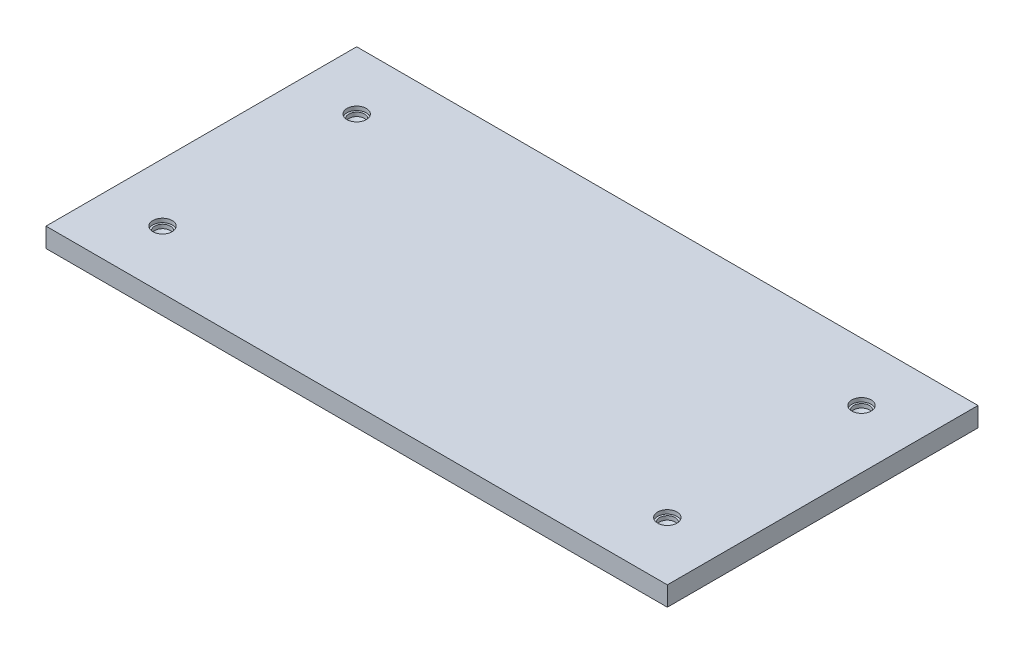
ISO-10303-21;
HEADER;
FILE_DESCRIPTION(('STEP AP214'),'2;1');
FILE_NAME('part.step','',(''),(''),'','','');
FILE_SCHEMA(('AUTOMOTIVE_DESIGN { 1 0 10303 214 1 1 1 1 }'));
ENDSEC;
DATA;
#1=APPLICATION_CONTEXT('core data for automotive mechanical design processes');
#2=APPLICATION_PROTOCOL_DEFINITION('international standard','automotive_design',2000,#1);
#3=PRODUCT_CONTEXT('',#1,'mechanical');
#4=PRODUCT('Part','Part','',(#3));
#5=PRODUCT_RELATED_PRODUCT_CATEGORY('part','',(#4));
#6=PRODUCT_DEFINITION_FORMATION('','',#4);
#7=PRODUCT_DEFINITION_CONTEXT('part definition',#1,'design');
#8=PRODUCT_DEFINITION('design','',#6,#7);
#9=PRODUCT_DEFINITION_SHAPE('','',#8);
#10=(LENGTH_UNIT() NAMED_UNIT(*) SI_UNIT(.MILLI.,.METRE.));
#11=(NAMED_UNIT(*) PLANE_ANGLE_UNIT() SI_UNIT($,.RADIAN.));
#12=(NAMED_UNIT(*) SI_UNIT($,.STERADIAN.) SOLID_ANGLE_UNIT());
#13=UNCERTAINTY_MEASURE_WITH_UNIT(LENGTH_MEASURE(1.E-05),#10,'distance_accuracy_value','');
#14=(GEOMETRIC_REPRESENTATION_CONTEXT(3) GLOBAL_UNCERTAINTY_ASSIGNED_CONTEXT((#13)) GLOBAL_UNIT_ASSIGNED_CONTEXT((#10,
#11,#12)) REPRESENTATION_CONTEXT('',''));
#15=CARTESIAN_POINT('',(0.,0.,0.));
#16=DIRECTION('',(0.,0.,1.));
#17=DIRECTION('',(1.,0.,0.));
#18=AXIS2_PLACEMENT_3D('',#15,#16,#17);
#19=CARTESIAN_POINT('',(101.6,6.35,50.8));
#20=DIRECTION('',(-1.,0.,0.));
#21=DIRECTION('',(0.,0.,1.));
#22=AXIS2_PLACEMENT_3D('',#19,#20,#21);
#23=PLANE('',#22);
#24=DIRECTION('',(0.,0.,-1.));
#25=VECTOR('',#24,1.);
#26=CARTESIAN_POINT('',(101.6,0.,50.8));
#27=LINE('',#26,#25);
#28=CARTESIAN_POINT('',(101.6,0.,50.8));
#29=VERTEX_POINT('',#28);
#30=CARTESIAN_POINT('',(101.6,0.,-50.8));
#31=VERTEX_POINT('',#30);
#32=EDGE_CURVE('E148',#29,#31,#27,.T.);
#33=ORIENTED_EDGE('',*,*,#32,.T.);
#34=DIRECTION('',(0.,-1.,0.));
#35=VECTOR('',#34,1.);
#36=CARTESIAN_POINT('',(101.6,6.35,-50.8));
#37=LINE('',#36,#35);
#38=CARTESIAN_POINT('',(101.6,6.35,-50.8));
#39=VERTEX_POINT('',#38);
#40=EDGE_CURVE('E11',#39,#31,#37,.T.);
#41=ORIENTED_EDGE('',*,*,#40,.F.);
#42=DIRECTION('',(0.,0.,-1.));
#43=VECTOR('',#42,1.);
#44=CARTESIAN_POINT('',(101.6,6.35,50.8));
#45=LINE('',#44,#43);
#46=CARTESIAN_POINT('',(101.6,6.35,50.8));
#47=VERTEX_POINT('',#46);
#48=EDGE_CURVE('E149',#47,#39,#45,.T.);
#49=ORIENTED_EDGE('',*,*,#48,.F.);
#50=DIRECTION('',(0.,-1.,0.));
#51=VECTOR('',#50,1.);
#52=CARTESIAN_POINT('',(101.6,6.35,50.8));
#53=LINE('',#52,#51);
#54=EDGE_CURVE('E155',#47,#29,#53,.T.);
#55=ORIENTED_EDGE('',*,*,#54,.T.);
#56=EDGE_LOOP('',(#33,#41,#49,#55));
#57=FACE_BOUND('',#56,.T.);
#58=ADVANCED_FACE('F35',(#57),#23,.F.);
#59=CARTESIAN_POINT('',(-101.6,6.35,-50.8));
#60=DIRECTION('',(0.,0.,1.));
#61=DIRECTION('',(1.,0.,0.));
#62=AXIS2_PLACEMENT_3D('',#59,#60,#61);
#63=PLANE('',#62);
#64=DIRECTION('',(-1.,0.,0.));
#65=VECTOR('',#64,1.);
#66=CARTESIAN_POINT('',(-101.6,0.,-50.8));
#67=LINE('',#66,#65);
#68=CARTESIAN_POINT('',(-101.6,0.,-50.8));
#69=VERTEX_POINT('',#68);
#70=EDGE_CURVE('E158',#31,#69,#67,.T.);
#71=ORIENTED_EDGE('',*,*,#70,.T.);
#72=DIRECTION('',(0.,-1.,0.));
#73=VECTOR('',#72,1.);
#74=CARTESIAN_POINT('',(-101.6,6.35,-50.8));
#75=LINE('',#74,#73);
#76=CARTESIAN_POINT('',(-101.6,6.35,-50.8));
#77=VERTEX_POINT('',#76);
#78=EDGE_CURVE('E43',#77,#69,#75,.T.);
#79=ORIENTED_EDGE('',*,*,#78,.F.);
#80=DIRECTION('',(-1.,0.,0.));
#81=VECTOR('',#80,1.);
#82=CARTESIAN_POINT('',(-101.6,6.35,-50.8));
#83=LINE('',#82,#81);
#84=EDGE_CURVE('E82',#39,#77,#83,.T.);
#85=ORIENTED_EDGE('',*,*,#84,.F.);
#86=ORIENTED_EDGE('',*,*,#40,.T.);
#87=EDGE_LOOP('',(#71,#79,#85,#86));
#88=FACE_BOUND('',#87,.T.);
#89=ADVANCED_FACE('F182',(#88),#63,.F.);
#90=CARTESIAN_POINT('',(-101.6,6.35,50.8));
#91=DIRECTION('',(1.,0.,0.));
#92=DIRECTION('',(0.,0.,-1.));
#93=AXIS2_PLACEMENT_3D('',#90,#91,#92);
#94=PLANE('',#93);
#95=DIRECTION('',(0.,0.,1.));
#96=VECTOR('',#95,1.);
#97=CARTESIAN_POINT('',(-101.6,0.,50.8));
#98=LINE('',#97,#96);
#99=CARTESIAN_POINT('',(-101.6,0.,50.8));
#100=VERTEX_POINT('',#99);
#101=EDGE_CURVE('E69',#69,#100,#98,.T.);
#102=ORIENTED_EDGE('',*,*,#101,.T.);
#103=DIRECTION('',(0.,-1.,0.));
#104=VECTOR('',#103,1.);
#105=CARTESIAN_POINT('',(-101.6,6.35,50.8));
#106=LINE('',#105,#104);
#107=CARTESIAN_POINT('',(-101.6,6.35,50.8));
#108=VERTEX_POINT('',#107);
#109=EDGE_CURVE('E163',#108,#100,#106,.T.);
#110=ORIENTED_EDGE('',*,*,#109,.F.);
#111=DIRECTION('',(0.,0.,1.));
#112=VECTOR('',#111,1.);
#113=CARTESIAN_POINT('',(-101.6,6.35,50.8));
#114=LINE('',#113,#112);
#115=EDGE_CURVE('E152',#77,#108,#114,.T.);
#116=ORIENTED_EDGE('',*,*,#115,.F.);
#117=ORIENTED_EDGE('',*,*,#78,.T.);
#118=EDGE_LOOP('',(#102,#110,#116,#117));
#119=FACE_BOUND('',#118,.T.);
#120=ADVANCED_FACE('F165',(#119),#94,.F.);
#121=CARTESIAN_POINT('',(-101.6,6.35,50.8));
#122=DIRECTION('',(0.,0.,-1.));
#123=DIRECTION('',(-1.,0.,0.));
#124=AXIS2_PLACEMENT_3D('',#121,#122,#123);
#125=PLANE('',#124);
#126=DIRECTION('',(1.,0.,0.));
#127=VECTOR('',#126,1.);
#128=CARTESIAN_POINT('',(-101.6,0.,50.8));
#129=LINE('',#128,#127);
#130=EDGE_CURVE('E75',#100,#29,#129,.T.);
#131=ORIENTED_EDGE('',*,*,#130,.T.);
#132=ORIENTED_EDGE('',*,*,#54,.F.);
#133=DIRECTION('',(1.,0.,0.));
#134=VECTOR('',#133,1.);
#135=CARTESIAN_POINT('',(-101.6,6.35,50.8));
#136=LINE('',#135,#134);
#137=EDGE_CURVE('E51',#108,#47,#136,.T.);
#138=ORIENTED_EDGE('',*,*,#137,.F.);
#139=ORIENTED_EDGE('',*,*,#109,.T.);
#140=EDGE_LOOP('',(#131,#132,#138,#139));
#141=FACE_BOUND('',#140,.T.);
#142=ADVANCED_FACE('F172',(#141),#125,.F.);
#143=CARTESIAN_POINT('',(0.,6.35,0.));
#144=DIRECTION('',(0.,-1.,0.));
#145=DIRECTION('',(0.,0.,-1.));
#146=AXIS2_PLACEMENT_3D('',#143,#144,#145);
#147=PLANE('',#146);
#148=CARTESIAN_POINT('',(82.55,6.35,31.75));
#149=DIRECTION('',(0.,1.,0.));
#150=DIRECTION('',(0.,0.,1.));
#151=AXIS2_PLACEMENT_3D('',#148,#149,#150);
#152=CIRCLE('',#151,3.175);
#153=CARTESIAN_POINT('',(82.55,6.35,34.925));
#154=VERTEX_POINT('',#153);
#155=EDGE_CURVE('E374',#154,#154,#152,.T.);
#156=ORIENTED_EDGE('',*,*,#155,.F.);
#157=EDGE_LOOP('',(#156));
#158=FACE_BOUND('',#157,.T.);
#159=CARTESIAN_POINT('',(-82.55,6.35,31.75));
#160=DIRECTION('',(0.,1.,0.));
#161=DIRECTION('',(0.,0.,1.));
#162=AXIS2_PLACEMENT_3D('',#159,#160,#161);
#163=CIRCLE('',#162,3.175);
#164=CARTESIAN_POINT('',(-82.55,6.35,34.925));
#165=VERTEX_POINT('',#164);
#166=EDGE_CURVE('E105',#165,#165,#163,.T.);
#167=ORIENTED_EDGE('',*,*,#166,.F.);
#168=EDGE_LOOP('',(#167));
#169=FACE_BOUND('',#168,.T.);
#170=CARTESIAN_POINT('',(82.55,6.35,-31.75));
#171=DIRECTION('',(0.,1.,0.));
#172=DIRECTION('',(0.,0.,1.));
#173=AXIS2_PLACEMENT_3D('',#170,#171,#172);
#174=CIRCLE('',#173,3.175);
#175=CARTESIAN_POINT('',(82.55,6.35,-28.575));
#176=VERTEX_POINT('',#175);
#177=EDGE_CURVE('E124',#176,#176,#174,.T.);
#178=ORIENTED_EDGE('',*,*,#177,.F.);
#179=EDGE_LOOP('',(#178));
#180=FACE_BOUND('',#179,.T.);
#181=CARTESIAN_POINT('',(-82.55,6.35,-31.75));
#182=DIRECTION('',(0.,1.,0.));
#183=DIRECTION('',(0.,0.,1.));
#184=AXIS2_PLACEMENT_3D('',#181,#182,#183);
#185=CIRCLE('',#184,3.175);
#186=CARTESIAN_POINT('',(-82.55,6.35,-28.575));
#187=VERTEX_POINT('',#186);
#188=EDGE_CURVE('E136',#187,#187,#185,.T.);
#189=ORIENTED_EDGE('',*,*,#188,.F.);
#190=EDGE_LOOP('',(#189));
#191=FACE_BOUND('',#190,.T.);
#192=ORIENTED_EDGE('',*,*,#48,.T.);
#193=ORIENTED_EDGE('',*,*,#84,.T.);
#194=ORIENTED_EDGE('',*,*,#115,.T.);
#195=ORIENTED_EDGE('',*,*,#137,.T.);
#196=EDGE_LOOP('',(#192,#193,#194,#195));
#197=FACE_BOUND('',#196,.T.);
#198=ADVANCED_FACE('F174',(#158,#169,#180,#191,#197),#147,.F.);
#199=CARTESIAN_POINT('',(0.,0.,0.));
#200=DIRECTION('',(0.,-1.,0.));
#201=DIRECTION('',(0.,0.,-1.));
#202=AXIS2_PLACEMENT_3D('',#199,#200,#201);
#203=PLANE('',#202);
#204=ORIENTED_EDGE('',*,*,#32,.F.);
#205=ORIENTED_EDGE('',*,*,#130,.F.);
#206=ORIENTED_EDGE('',*,*,#101,.F.);
#207=ORIENTED_EDGE('',*,*,#70,.F.);
#208=EDGE_LOOP('',(#204,#205,#206,#207));
#209=FACE_BOUND('',#208,.T.);
#210=ADVANCED_FACE('F168',(#209),#203,.T.);
#211=CARTESIAN_POINT('',(-82.55,3.81,-31.75));
#212=DIRECTION('',(0.,1.,0.));
#213=DIRECTION('',(0.,0.,1.));
#214=AXIS2_PLACEMENT_3D('',#211,#212,#213);
#215=CONICAL_SURFACE('',#214,2.55270000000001,1.02974425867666);
#216=CARTESIAN_POINT('',(-82.55,2.27618309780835,-31.75));
#217=VERTEX_POINT('',#216);
#218=VERTEX_LOOP('',#217);
#219=FACE_BOUND('',#218,.T.);
#220=CARTESIAN_POINT('',(-82.55,3.81,-31.75));
#221=DIRECTION('',(0.,1.,0.));
#222=DIRECTION('',(0.,0.,1.));
#223=AXIS2_PLACEMENT_3D('',#220,#221,#222);
#224=CIRCLE('',#223,2.55270000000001);
#225=CARTESIAN_POINT('',(-82.55,3.81,-29.1973));
#226=VERTEX_POINT('',#225);
#227=EDGE_CURVE('E145',#226,#226,#224,.T.);
#228=ORIENTED_EDGE('',*,*,#227,.T.);
#229=EDGE_LOOP('',(#228));
#230=FACE_BOUND('',#229,.T.);
#231=ADVANCED_FACE('F209',(#219,#230),#215,.F.);
#232=CARTESIAN_POINT('',(-82.55,6.35,-31.75));
#233=DIRECTION('',(0.,1.,0.));
#234=DIRECTION('',(0.,0.,1.));
#235=AXIS2_PLACEMENT_3D('',#232,#233,#234);
#236=CYLINDRICAL_SURFACE('',#235,2.55270000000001);
#237=ORIENTED_EDGE('',*,*,#227,.F.);
#238=EDGE_LOOP('',(#237));
#239=FACE_BOUND('',#238,.T.);
#240=CARTESIAN_POINT('',(-82.55,5.08,-31.75));
#241=DIRECTION('',(0.,1.,0.));
#242=DIRECTION('',(0.,0.,1.));
#243=AXIS2_PLACEMENT_3D('',#240,#241,#242);
#244=CIRCLE('',#243,2.55270000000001);
#245=CARTESIAN_POINT('',(-82.55,5.08,-29.1973));
#246=VERTEX_POINT('',#245);
#247=EDGE_CURVE('E142',#246,#246,#244,.T.);
#248=ORIENTED_EDGE('',*,*,#247,.T.);
#249=EDGE_LOOP('',(#248));
#250=FACE_BOUND('',#249,.T.);
#251=ADVANCED_FACE('F217',(#239,#250),#236,.F.);
#252=CARTESIAN_POINT('',(-79.9973,5.08,-31.75));
#253=DIRECTION('',(0.,-1.,0.));
#254=DIRECTION('',(0.,0.,-1.));
#255=AXIS2_PLACEMENT_3D('',#252,#253,#254);
#256=PLANE('',#255);
#257=ORIENTED_EDGE('',*,*,#247,.F.);
#258=EDGE_LOOP('',(#257));
#259=FACE_BOUND('',#258,.T.);
#260=CARTESIAN_POINT('',(-82.55,5.08,-31.75));
#261=DIRECTION('',(0.,1.,0.));
#262=DIRECTION('',(0.,0.,1.));
#263=AXIS2_PLACEMENT_3D('',#260,#261,#262);
#264=CIRCLE('',#263,3.175);
#265=CARTESIAN_POINT('',(-82.55,5.08,-28.575));
#266=VERTEX_POINT('',#265);
#267=EDGE_CURVE('E139',#266,#266,#264,.T.);
#268=ORIENTED_EDGE('',*,*,#267,.T.);
#269=EDGE_LOOP('',(#268));
#270=FACE_BOUND('',#269,.T.);
#271=ADVANCED_FACE('F227',(#259,#270),#256,.F.);
#272=CARTESIAN_POINT('',(-82.55,6.35,-31.75));
#273=DIRECTION('',(0.,1.,0.));
#274=DIRECTION('',(0.,0.,1.));
#275=AXIS2_PLACEMENT_3D('',#272,#273,#274);
#276=CYLINDRICAL_SURFACE('',#275,3.175);
#277=ORIENTED_EDGE('',*,*,#267,.F.);
#278=EDGE_LOOP('',(#277));
#279=FACE_BOUND('',#278,.T.);
#280=ORIENTED_EDGE('',*,*,#188,.T.);
#281=EDGE_LOOP('',(#280));
#282=FACE_BOUND('',#281,.T.);
#283=ADVANCED_FACE('F237',(#279,#282),#276,.F.);
#284=CARTESIAN_POINT('',(82.55,3.81,-31.75));
#285=DIRECTION('',(0.,1.,0.));
#286=DIRECTION('',(0.,0.,1.));
#287=AXIS2_PLACEMENT_3D('',#284,#285,#286);
#288=CONICAL_SURFACE('',#287,2.55270000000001,1.02974425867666);
#289=CARTESIAN_POINT('',(82.55,2.27618309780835,-31.75));
#290=VERTEX_POINT('',#289);
#291=VERTEX_LOOP('',#290);
#292=FACE_BOUND('',#291,.T.);
#293=CARTESIAN_POINT('',(82.55,3.81,-31.75));
#294=DIRECTION('',(0.,1.,0.));
#295=DIRECTION('',(0.,0.,1.));
#296=AXIS2_PLACEMENT_3D('',#293,#294,#295);
#297=CIRCLE('',#296,2.55270000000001);
#298=CARTESIAN_POINT('',(82.55,3.81,-29.1973));
#299=VERTEX_POINT('',#298);
#300=EDGE_CURVE('E133',#299,#299,#297,.T.);
#301=ORIENTED_EDGE('',*,*,#300,.T.);
#302=EDGE_LOOP('',(#301));
#303=FACE_BOUND('',#302,.T.);
#304=ADVANCED_FACE('F247',(#292,#303),#288,.F.);
#305=CARTESIAN_POINT('',(82.55,6.35,-31.75));
#306=DIRECTION('',(0.,1.,0.));
#307=DIRECTION('',(0.,0.,1.));
#308=AXIS2_PLACEMENT_3D('',#305,#306,#307);
#309=CYLINDRICAL_SURFACE('',#308,2.55270000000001);
#310=ORIENTED_EDGE('',*,*,#300,.F.);
#311=EDGE_LOOP('',(#310));
#312=FACE_BOUND('',#311,.T.);
#313=CARTESIAN_POINT('',(82.55,5.08,-31.75));
#314=DIRECTION('',(0.,1.,0.));
#315=DIRECTION('',(0.,0.,1.));
#316=AXIS2_PLACEMENT_3D('',#313,#314,#315);
#317=CIRCLE('',#316,2.55270000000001);
#318=CARTESIAN_POINT('',(82.55,5.08,-29.1973));
#319=VERTEX_POINT('',#318);
#320=EDGE_CURVE('E130',#319,#319,#317,.T.);
#321=ORIENTED_EDGE('',*,*,#320,.T.);
#322=EDGE_LOOP('',(#321));
#323=FACE_BOUND('',#322,.T.);
#324=ADVANCED_FACE('F257',(#312,#323),#309,.F.);
#325=CARTESIAN_POINT('',(85.1027,5.08,-31.75));
#326=DIRECTION('',(0.,-1.,0.));
#327=DIRECTION('',(0.,0.,-1.));
#328=AXIS2_PLACEMENT_3D('',#325,#326,#327);
#329=PLANE('',#328);
#330=ORIENTED_EDGE('',*,*,#320,.F.);
#331=EDGE_LOOP('',(#330));
#332=FACE_BOUND('',#331,.T.);
#333=CARTESIAN_POINT('',(82.55,5.08,-31.75));
#334=DIRECTION('',(0.,1.,0.));
#335=DIRECTION('',(0.,0.,1.));
#336=AXIS2_PLACEMENT_3D('',#333,#334,#335);
#337=CIRCLE('',#336,3.175);
#338=CARTESIAN_POINT('',(82.55,5.08,-28.575));
#339=VERTEX_POINT('',#338);
#340=EDGE_CURVE('E127',#339,#339,#337,.T.);
#341=ORIENTED_EDGE('',*,*,#340,.T.);
#342=EDGE_LOOP('',(#341));
#343=FACE_BOUND('',#342,.T.);
#344=ADVANCED_FACE('F267',(#332,#343),#329,.F.);
#345=CARTESIAN_POINT('',(82.55,6.35,-31.75));
#346=DIRECTION('',(0.,1.,0.));
#347=DIRECTION('',(0.,0.,1.));
#348=AXIS2_PLACEMENT_3D('',#345,#346,#347);
#349=CYLINDRICAL_SURFACE('',#348,3.175);
#350=ORIENTED_EDGE('',*,*,#340,.F.);
#351=EDGE_LOOP('',(#350));
#352=FACE_BOUND('',#351,.T.);
#353=ORIENTED_EDGE('',*,*,#177,.T.);
#354=EDGE_LOOP('',(#353));
#355=FACE_BOUND('',#354,.T.);
#356=ADVANCED_FACE('F277',(#352,#355),#349,.F.);
#357=CARTESIAN_POINT('',(-82.55,3.81,31.75));
#358=DIRECTION('',(0.,1.,0.));
#359=DIRECTION('',(0.,0.,1.));
#360=AXIS2_PLACEMENT_3D('',#357,#358,#359);
#361=CONICAL_SURFACE('',#360,2.55270000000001,1.02974425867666);
#362=CARTESIAN_POINT('',(-82.55,2.27618309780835,31.75));
#363=VERTEX_POINT('',#362);
#364=VERTEX_LOOP('',#363);
#365=FACE_BOUND('',#364,.T.);
#366=CARTESIAN_POINT('',(-82.55,3.81,31.75));
#367=DIRECTION('',(0.,1.,0.));
#368=DIRECTION('',(0.,0.,1.));
#369=AXIS2_PLACEMENT_3D('',#366,#367,#368);
#370=CIRCLE('',#369,2.55270000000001);
#371=CARTESIAN_POINT('',(-82.55,3.81,34.3027));
#372=VERTEX_POINT('',#371);
#373=EDGE_CURVE('E121',#372,#372,#370,.T.);
#374=ORIENTED_EDGE('',*,*,#373,.T.);
#375=EDGE_LOOP('',(#374));
#376=FACE_BOUND('',#375,.T.);
#377=ADVANCED_FACE('F287',(#365,#376),#361,.F.);
#378=CARTESIAN_POINT('',(-82.55,6.35,31.75));
#379=DIRECTION('',(0.,1.,0.));
#380=DIRECTION('',(0.,0.,1.));
#381=AXIS2_PLACEMENT_3D('',#378,#379,#380);
#382=CYLINDRICAL_SURFACE('',#381,2.55270000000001);
#383=ORIENTED_EDGE('',*,*,#373,.F.);
#384=EDGE_LOOP('',(#383));
#385=FACE_BOUND('',#384,.T.);
#386=CARTESIAN_POINT('',(-82.55,5.08,31.75));
#387=DIRECTION('',(0.,1.,0.));
#388=DIRECTION('',(0.,0.,1.));
#389=AXIS2_PLACEMENT_3D('',#386,#387,#388);
#390=CIRCLE('',#389,2.55270000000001);
#391=CARTESIAN_POINT('',(-82.55,5.08,34.3027));
#392=VERTEX_POINT('',#391);
#393=EDGE_CURVE('E118',#392,#392,#390,.T.);
#394=ORIENTED_EDGE('',*,*,#393,.T.);
#395=EDGE_LOOP('',(#394));
#396=FACE_BOUND('',#395,.T.);
#397=ADVANCED_FACE('F302',(#385,#396),#382,.F.);
#398=CARTESIAN_POINT('',(-79.9973,5.08,31.75));
#399=DIRECTION('',(0.,-1.,0.));
#400=DIRECTION('',(0.,0.,-1.));
#401=AXIS2_PLACEMENT_3D('',#398,#399,#400);
#402=PLANE('',#401);
#403=ORIENTED_EDGE('',*,*,#393,.F.);
#404=EDGE_LOOP('',(#403));
#405=FACE_BOUND('',#404,.T.);
#406=CARTESIAN_POINT('',(-82.55,5.08,31.75));
#407=DIRECTION('',(0.,1.,0.));
#408=DIRECTION('',(0.,0.,1.));
#409=AXIS2_PLACEMENT_3D('',#406,#407,#408);
#410=CIRCLE('',#409,3.175);
#411=CARTESIAN_POINT('',(-82.55,5.08,34.925));
#412=VERTEX_POINT('',#411);
#413=EDGE_CURVE('E109',#412,#412,#410,.T.);
#414=ORIENTED_EDGE('',*,*,#413,.T.);
#415=EDGE_LOOP('',(#414));
#416=FACE_BOUND('',#415,.T.);
#417=ADVANCED_FACE('F312',(#405,#416),#402,.F.);
#418=CARTESIAN_POINT('',(-82.55,6.35,31.75));
#419=DIRECTION('',(0.,1.,0.));
#420=DIRECTION('',(0.,0.,1.));
#421=AXIS2_PLACEMENT_3D('',#418,#419,#420);
#422=CYLINDRICAL_SURFACE('',#421,3.175);
#423=ORIENTED_EDGE('',*,*,#413,.F.);
#424=EDGE_LOOP('',(#423));
#425=FACE_BOUND('',#424,.T.);
#426=ORIENTED_EDGE('',*,*,#166,.T.);
#427=EDGE_LOOP('',(#426));
#428=FACE_BOUND('',#427,.T.);
#429=ADVANCED_FACE('F99',(#425,#428),#422,.F.);
#430=CARTESIAN_POINT('',(82.55,3.81,31.75));
#431=DIRECTION('',(0.,1.,0.));
#432=DIRECTION('',(0.,0.,1.));
#433=AXIS2_PLACEMENT_3D('',#430,#431,#432);
#434=CONICAL_SURFACE('',#433,2.55270000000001,1.02974425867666);
#435=CARTESIAN_POINT('',(82.55,2.27618309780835,31.75));
#436=VERTEX_POINT('',#435);
#437=VERTEX_LOOP('',#436);
#438=FACE_BOUND('',#437,.T.);
#439=CARTESIAN_POINT('',(82.55,3.81,31.75));
#440=DIRECTION('',(0.,1.,0.));
#441=DIRECTION('',(0.,0.,1.));
#442=AXIS2_PLACEMENT_3D('',#439,#440,#441);
#443=CIRCLE('',#442,2.55270000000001);
#444=CARTESIAN_POINT('',(82.55,3.81,34.3027));
#445=VERTEX_POINT('',#444);
#446=EDGE_CURVE('E103',#445,#445,#443,.T.);
#447=ORIENTED_EDGE('',*,*,#446,.T.);
#448=EDGE_LOOP('',(#447));
#449=FACE_BOUND('',#448,.T.);
#450=ADVANCED_FACE('F95',(#438,#449),#434,.F.);
#451=CARTESIAN_POINT('',(82.55,6.35,31.75));
#452=DIRECTION('',(0.,1.,0.));
#453=DIRECTION('',(0.,0.,1.));
#454=AXIS2_PLACEMENT_3D('',#451,#452,#453);
#455=CYLINDRICAL_SURFACE('',#454,2.55270000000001);
#456=ORIENTED_EDGE('',*,*,#446,.F.);
#457=EDGE_LOOP('',(#456));
#458=FACE_BOUND('',#457,.T.);
#459=CARTESIAN_POINT('',(82.55,5.08,31.75));
#460=DIRECTION('',(0.,1.,0.));
#461=DIRECTION('',(0.,0.,1.));
#462=AXIS2_PLACEMENT_3D('',#459,#460,#461);
#463=CIRCLE('',#462,2.55270000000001);
#464=CARTESIAN_POINT('',(82.55,5.08,34.3027));
#465=VERTEX_POINT('',#464);
#466=EDGE_CURVE('E106',#465,#465,#463,.T.);
#467=ORIENTED_EDGE('',*,*,#466,.T.);
#468=EDGE_LOOP('',(#467));
#469=FACE_BOUND('',#468,.T.);
#470=ADVANCED_FACE('F98',(#458,#469),#455,.F.);
#471=CARTESIAN_POINT('',(85.1027,5.08,31.75));
#472=DIRECTION('',(0.,-1.,0.));
#473=DIRECTION('',(0.,0.,-1.));
#474=AXIS2_PLACEMENT_3D('',#471,#472,#473);
#475=PLANE('',#474);
#476=ORIENTED_EDGE('',*,*,#466,.F.);
#477=EDGE_LOOP('',(#476));
#478=FACE_BOUND('',#477,.T.);
#479=CARTESIAN_POINT('',(82.55,5.08,31.75));
#480=DIRECTION('',(0.,1.,0.));
#481=DIRECTION('',(0.,0.,1.));
#482=AXIS2_PLACEMENT_3D('',#479,#480,#481);
#483=CIRCLE('',#482,3.175);
#484=CARTESIAN_POINT('',(82.55,5.08,34.925));
#485=VERTEX_POINT('',#484);
#486=EDGE_CURVE('E112',#485,#485,#483,.T.);
#487=ORIENTED_EDGE('',*,*,#486,.T.);
#488=EDGE_LOOP('',(#487));
#489=FACE_BOUND('',#488,.T.);
#490=ADVANCED_FACE('F346',(#478,#489),#475,.F.);
#491=CARTESIAN_POINT('',(82.55,6.35,31.75));
#492=DIRECTION('',(0.,1.,0.));
#493=DIRECTION('',(0.,0.,1.));
#494=AXIS2_PLACEMENT_3D('',#491,#492,#493);
#495=CYLINDRICAL_SURFACE('',#494,3.175);
#496=ORIENTED_EDGE('',*,*,#486,.F.);
#497=EDGE_LOOP('',(#496));
#498=FACE_BOUND('',#497,.T.);
#499=ORIENTED_EDGE('',*,*,#155,.T.);
#500=EDGE_LOOP('',(#499));
#501=FACE_BOUND('',#500,.T.);
#502=ADVANCED_FACE('F355',(#498,#501),#495,.F.);
#503=CLOSED_SHELL('',(#58,#89,#120,#142,#198,#210,#231,#251,#271,#283,#304,#324,#344,#356,#377,
#397,#417,#429,#450,#470,#490,#502));
#504=MANIFOLD_SOLID_BREP('B2',#503);
#505=ADVANCED_BREP_SHAPE_REPRESENTATION('',(#18,#504),#14);
#506=SHAPE_DEFINITION_REPRESENTATION(#9,#505);
ENDSEC;
END-ISO-10303-21;
